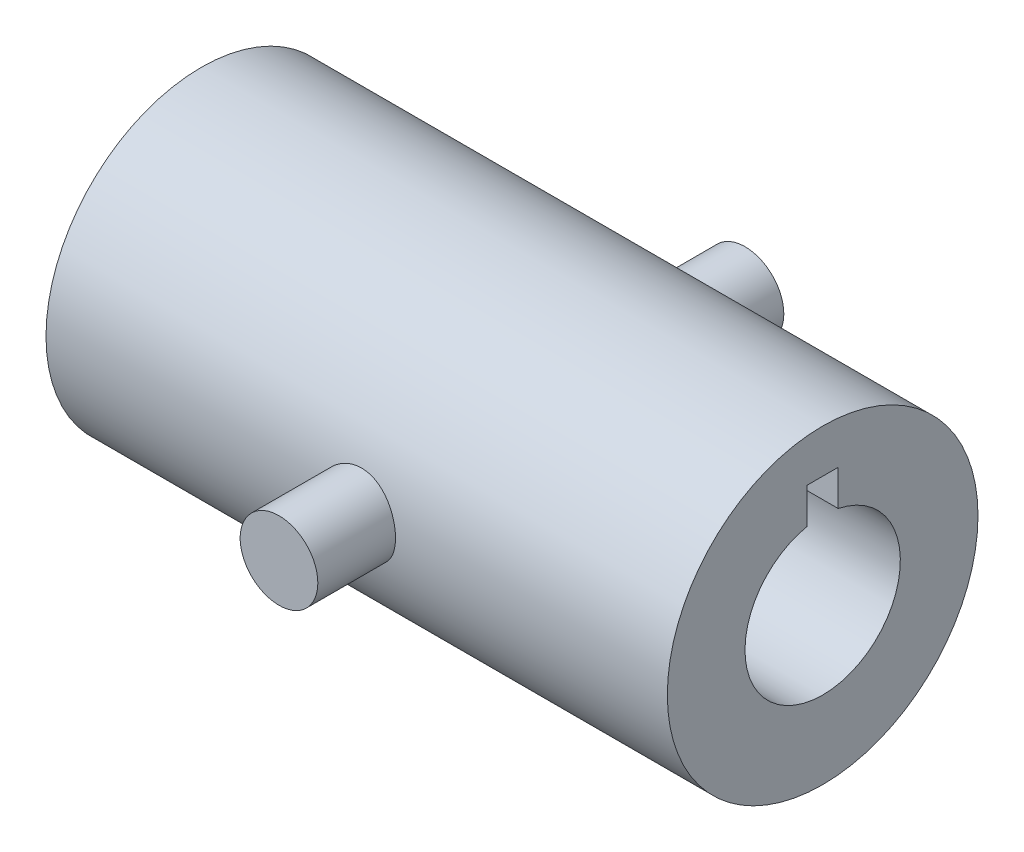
ISO-10303-21;
HEADER;
FILE_DESCRIPTION(('STEP AP214'),'2;1');
FILE_NAME('part.step','',(''),(''),'','','');
FILE_SCHEMA(('AUTOMOTIVE_DESIGN { 1 0 10303 214 1 1 1 1 }'));
ENDSEC;
DATA;
#1=APPLICATION_CONTEXT('core data for automotive mechanical design processes');
#2=APPLICATION_PROTOCOL_DEFINITION('international standard','automotive_design',2000,#1);
#3=PRODUCT_CONTEXT('',#1,'mechanical');
#4=PRODUCT('Part','Part','',(#3));
#5=PRODUCT_RELATED_PRODUCT_CATEGORY('part','',(#4));
#6=PRODUCT_DEFINITION_FORMATION('','',#4);
#7=PRODUCT_DEFINITION_CONTEXT('part definition',#1,'design');
#8=PRODUCT_DEFINITION('design','',#6,#7);
#9=PRODUCT_DEFINITION_SHAPE('','',#8);
#10=(LENGTH_UNIT() NAMED_UNIT(*) SI_UNIT(.MILLI.,.METRE.));
#11=(NAMED_UNIT(*) PLANE_ANGLE_UNIT() SI_UNIT($,.RADIAN.));
#12=(NAMED_UNIT(*) SI_UNIT($,.STERADIAN.) SOLID_ANGLE_UNIT());
#13=UNCERTAINTY_MEASURE_WITH_UNIT(LENGTH_MEASURE(1.E-05),#10,'distance_accuracy_value','');
#14=(GEOMETRIC_REPRESENTATION_CONTEXT(3) GLOBAL_UNCERTAINTY_ASSIGNED_CONTEXT((#13)) GLOBAL_UNIT_ASSIGNED_CONTEXT((#10,
#11,#12)) REPRESENTATION_CONTEXT('',''));
#15=CARTESIAN_POINT('',(0.,0.,0.));
#16=DIRECTION('',(0.,0.,1.));
#17=DIRECTION('',(1.,0.,0.));
#18=AXIS2_PLACEMENT_3D('',#15,#16,#17);
#19=CARTESIAN_POINT('',(50.8,0.,0.));
#20=DIRECTION('',(-1.,0.,0.));
#21=DIRECTION('',(0.,0.,1.));
#22=AXIS2_PLACEMENT_3D('',#19,#20,#21);
#23=CYLINDRICAL_SURFACE('',#22,12.7);
#24=CARTESIAN_POINT('',(22.225,0.,-12.7));
#25=CARTESIAN_POINT('',(22.2250049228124,0.175421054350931,-12.6999970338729));
#26=CARTESIAN_POINT('',(22.2395871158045,0.350897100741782,-12.6963292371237));
#27=CARTESIAN_POINT('',(22.2974432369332,0.696820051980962,-12.6820530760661));
#28=CARTESIAN_POINT('',(22.3407334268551,0.867264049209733,-12.6714407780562));
#29=CARTESIAN_POINT('',(22.4545297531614,1.19807751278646,-12.6444507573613));
#30=CARTESIAN_POINT('',(22.5250032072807,1.35845880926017,-12.6280799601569));
#31=CARTESIAN_POINT('',(22.6910506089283,1.66512267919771,-12.591316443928));
#32=CARTESIAN_POINT('',(22.7866254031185,1.81140477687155,-12.5709235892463));
#33=CARTESIAN_POINT('',(23.0022416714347,2.08873074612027,-12.5278602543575));
#34=CARTESIAN_POINT('',(23.1227028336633,2.21944287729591,-12.5051546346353));
#35=CARTESIAN_POINT('',(23.3837738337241,2.45903522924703,-12.4602582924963));
#36=CARTESIAN_POINT('',(23.524385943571,2.56791298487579,-12.4380676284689));
#37=CARTESIAN_POINT('',(23.8243432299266,2.76230618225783,-12.3963594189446));
#38=CARTESIAN_POINT('',(23.9839356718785,2.84745052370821,-12.3768864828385));
#39=CARTESIAN_POINT('',(24.3157341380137,2.98957345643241,-12.343330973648));
#40=CARTESIAN_POINT('',(24.4879381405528,3.04655655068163,-12.3292475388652));
#41=CARTESIAN_POINT('',(24.8364237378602,3.12960773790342,-12.3084267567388));
#42=CARTESIAN_POINT('',(25.0125545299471,3.15627230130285,-12.3015478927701));
#43=CARTESIAN_POINT('',(25.3669134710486,3.17978742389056,-12.2954915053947));
#44=CARTESIAN_POINT('',(25.5451412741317,3.176642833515,-12.2963127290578));
#45=CARTESIAN_POINT('',(25.8940634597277,3.14110481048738,-12.3054365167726));
#46=CARTESIAN_POINT('',(26.0648357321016,3.10942215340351,-12.3135572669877));
#47=CARTESIAN_POINT('',(26.3985608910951,3.01884119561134,-12.3360753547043));
#48=CARTESIAN_POINT('',(26.5615132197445,2.95994095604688,-12.3504731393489));
#49=CARTESIAN_POINT('',(26.876878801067,2.81599106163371,-12.3840899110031));
#50=CARTESIAN_POINT('',(27.0291690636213,2.73068344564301,-12.4033560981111));
#51=CARTESIAN_POINT('',(27.3175279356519,2.53652078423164,-12.4445122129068));
#52=CARTESIAN_POINT('',(27.4535937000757,2.42766161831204,-12.4664025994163));
#53=CARTESIAN_POINT('',(27.7097143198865,2.18580424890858,-12.5111061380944));
#54=CARTESIAN_POINT('',(27.8292020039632,2.05220624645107,-12.533927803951));
#55=CARTESIAN_POINT('',(28.0441849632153,1.76659522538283,-12.5773596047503));
#56=CARTESIAN_POINT('',(28.1396795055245,1.61458164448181,-12.5979696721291));
#57=CARTESIAN_POINT('',(28.3041737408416,1.29564529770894,-12.6347586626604));
#58=CARTESIAN_POINT('',(28.3730813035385,1.12867311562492,-12.6509221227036));
#59=CARTESIAN_POINT('',(28.4816916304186,0.785020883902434,-12.676884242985));
#60=CARTESIAN_POINT('',(28.5213999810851,0.608342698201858,-12.6866841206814));
#61=CARTESIAN_POINT('',(28.5696185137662,0.255142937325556,-12.6986347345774));
#62=CARTESIAN_POINT('',(28.5789010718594,0.0787330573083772,-12.7009747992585));
#63=CARTESIAN_POINT('',(28.5681229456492,-0.273119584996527,-12.6982813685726));
#64=CARTESIAN_POINT('',(28.5480649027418,-0.448562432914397,-12.6932485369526));
#65=CARTESIAN_POINT('',(28.4798115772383,-0.790816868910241,-12.6764961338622));
#66=CARTESIAN_POINT('',(28.4320376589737,-0.957717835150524,-12.6648767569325));
#67=CARTESIAN_POINT('',(28.3101900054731,-1.28112793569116,-12.6362609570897));
#68=CARTESIAN_POINT('',(28.2361136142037,-1.43763601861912,-12.6192639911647));
#69=CARTESIAN_POINT('',(28.0622668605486,-1.73889063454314,-12.5813250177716));
#70=CARTESIAN_POINT('',(27.9620638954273,-1.88337918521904,-12.5603183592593));
#71=CARTESIAN_POINT('',(27.7393613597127,-2.15376466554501,-12.5167921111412));
#72=CARTESIAN_POINT('',(27.6168579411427,-2.27965837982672,-12.4942722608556));
#73=CARTESIAN_POINT('',(27.3494458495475,-2.51246336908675,-12.4495762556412));
#74=CARTESIAN_POINT('',(27.2040610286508,-2.6188328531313,-12.4274221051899));
#75=CARTESIAN_POINT('',(26.8970492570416,-2.80566443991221,-12.3865825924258));
#76=CARTESIAN_POINT('',(26.735423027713,-2.88612769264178,-12.3678970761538));
#77=CARTESIAN_POINT('',(26.401382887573,-3.01826384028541,-12.3363163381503));
#78=CARTESIAN_POINT('',(26.229039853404,-3.07010730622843,-12.3233869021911));
#79=CARTESIAN_POINT('',(25.8777112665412,-3.14398164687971,-12.3047494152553));
#80=CARTESIAN_POINT('',(25.6987271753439,-3.16601904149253,-12.299039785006));
#81=CARTESIAN_POINT('',(25.3447104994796,-3.17931501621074,-12.2956087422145));
#82=CARTESIAN_POINT('',(25.1697120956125,-3.17143955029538,-12.2976625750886));
#83=CARTESIAN_POINT('',(24.8236234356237,-3.1271152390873,-12.3090074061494));
#84=CARTESIAN_POINT('',(24.6525331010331,-3.09066696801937,-12.3182982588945));
#85=CARTESIAN_POINT('',(24.3200587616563,-2.9907046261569,-12.3429450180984));
#86=CARTESIAN_POINT('',(24.1586230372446,-2.92735297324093,-12.3582644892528));
#87=CARTESIAN_POINT('',(23.8485566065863,-2.7755107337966,-12.3932474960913));
#88=CARTESIAN_POINT('',(23.6999276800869,-2.68701666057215,-12.4129116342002));
#89=CARTESIAN_POINT('',(23.4155093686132,-2.48468673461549,-12.4550092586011));
#90=CARTESIAN_POINT('',(23.2801560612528,-2.37025002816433,-12.4775016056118));
#91=CARTESIAN_POINT('',(23.0302920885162,-2.12045416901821,-12.5223699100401));
#92=CARTESIAN_POINT('',(22.9157863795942,-1.98509005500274,-12.5447458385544));
#93=CARTESIAN_POINT('',(22.7088460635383,-1.6943230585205,-12.5873437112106));
#94=CARTESIAN_POINT('',(22.6168487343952,-1.53860166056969,-12.6075193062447));
#95=CARTESIAN_POINT('',(22.4604845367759,-1.21341315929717,-12.6429542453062));
#96=CARTESIAN_POINT('',(22.3960978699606,-1.04395600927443,-12.6582171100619));
#97=CARTESIAN_POINT('',(22.3063396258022,-0.729001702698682,-12.6798505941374));
#98=CARTESIAN_POINT('',(22.2759032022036,-0.585004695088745,-12.6873547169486));
#99=CARTESIAN_POINT('',(22.2352320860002,-0.294017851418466,-12.6974304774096));
#100=CARTESIAN_POINT('',(22.2249958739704,-0.147028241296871,-12.7000024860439));
#101=CARTESIAN_POINT('',(22.225,0.,-12.7));
#102=B_SPLINE_CURVE_WITH_KNOTS('',3,(#24,#25,#26,#27,#28,#29,#30,#31,#32,#33,#34,#35,#36,#37,
#38,#39,#40,#41,#42,#43,#44,#45,#46,#47,#48,#49,#50,#51,#52,#53,#54,#55,#56,#57,#58,#59,#60,#61,
#62,#63,#64,#65,#66,#67,#68,#69,#70,#71,#72,#73,#74,#75,#76,#77,#78,#79,#80,#81,#82,#83,#84,#85,
#86,#87,#88,#89,#90,#91,#92,#93,#94,#95,#96,#97,#98,#99,#100,#101),.UNSPECIFIED.,.T.,.F.,(4,2,2,
2,2,2,2,2,2,2,2,2,2,2,2,2,2,2,2,2,2,2,2,2,2,2,2,2,2,2,2,2,2,2,2,2,2,2,4),(0.,0.5257243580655,
1.05174676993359,1.57713870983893,2.10254837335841,2.63767221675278,3.17285644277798,
3.71599137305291,4.25903942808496,4.79120824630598,5.32329047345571,5.84247618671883,
6.36169889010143,6.8861628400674,7.41071862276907,7.9502317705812,8.48976139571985,
9.03114418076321,9.57242335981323,10.09985087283,10.6272309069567,11.1467958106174,
11.6664131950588,12.1952509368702,12.7241800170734,13.266092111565,13.8079801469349,
14.34660272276,14.8851074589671,15.4081433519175,15.9311687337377,16.4510804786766,
16.9710643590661,17.5046127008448,18.0382877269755,18.5816279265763,19.1245778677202,
19.5652441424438,20.005877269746),.UNSPECIFIED.);
#103=CARTESIAN_POINT('',(22.225,0.,-12.7));
#104=VERTEX_POINT('',#103);
#105=EDGE_CURVE('E43',#104,#104,#102,.T.);
#106=ORIENTED_EDGE('',*,*,#105,.F.);
#107=EDGE_LOOP('',(#106));
#108=FACE_BOUND('',#107,.T.);
#109=CARTESIAN_POINT('',(50.8,0.,0.));
#110=DIRECTION('',(1.,0.,0.));
#111=DIRECTION('',(0.,0.,-1.));
#112=AXIS2_PLACEMENT_3D('',#109,#110,#111);
#113=CIRCLE('',#112,12.7);
#114=CARTESIAN_POINT('',(50.8,0.,-12.7));
#115=VERTEX_POINT('',#114);
#116=EDGE_CURVE('E113',#115,#115,#113,.T.);
#117=ORIENTED_EDGE('',*,*,#116,.F.);
#118=EDGE_LOOP('',(#117));
#119=FACE_BOUND('',#118,.T.);
#120=CARTESIAN_POINT('',(0.,0.,0.));
#121=DIRECTION('',(1.,0.,0.));
#122=DIRECTION('',(0.,0.,-1.));
#123=AXIS2_PLACEMENT_3D('',#120,#121,#122);
#124=CIRCLE('',#123,12.7);
#125=CARTESIAN_POINT('',(0.,0.,-12.7));
#126=VERTEX_POINT('',#125);
#127=EDGE_CURVE('E38',#126,#126,#124,.T.);
#128=ORIENTED_EDGE('',*,*,#127,.T.);
#129=EDGE_LOOP('',(#128));
#130=FACE_BOUND('',#129,.T.);
#131=CARTESIAN_POINT('',(28.575,0.,12.7));
#132=CARTESIAN_POINT('',(28.5749950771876,0.175421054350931,12.6999970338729));
#133=CARTESIAN_POINT('',(28.5604128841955,0.350897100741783,12.6963292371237));
#134=CARTESIAN_POINT('',(28.5025567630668,0.696820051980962,12.6820530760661));
#135=CARTESIAN_POINT('',(28.4592665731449,0.867264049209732,12.6714407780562));
#136=CARTESIAN_POINT('',(28.3454702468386,1.19807751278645,12.6444507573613));
#137=CARTESIAN_POINT('',(28.2749967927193,1.35845880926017,12.6280799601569));
#138=CARTESIAN_POINT('',(28.1089493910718,1.6651226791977,12.591316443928));
#139=CARTESIAN_POINT('',(28.0133745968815,1.81140477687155,12.5709235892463));
#140=CARTESIAN_POINT('',(27.7977583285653,2.08873074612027,12.5278602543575));
#141=CARTESIAN_POINT('',(27.6772971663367,2.2194428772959,12.5051546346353));
#142=CARTESIAN_POINT('',(27.4162261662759,2.45903522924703,12.4602582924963));
#143=CARTESIAN_POINT('',(27.275614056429,2.56791298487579,12.4380676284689));
#144=CARTESIAN_POINT('',(26.9756567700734,2.76230618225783,12.3963594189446));
#145=CARTESIAN_POINT('',(26.8160643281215,2.84745052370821,12.3768864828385));
#146=CARTESIAN_POINT('',(26.4842658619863,2.98957345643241,12.343330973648));
#147=CARTESIAN_POINT('',(26.3120618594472,3.04655655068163,12.3292475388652));
#148=CARTESIAN_POINT('',(25.9635762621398,3.12960773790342,12.3084267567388));
#149=CARTESIAN_POINT('',(25.7874454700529,3.15627230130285,12.3015478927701));
#150=CARTESIAN_POINT('',(25.4330865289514,3.17978742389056,12.2954915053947));
#151=CARTESIAN_POINT('',(25.2548587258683,3.176642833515,12.2963127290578));
#152=CARTESIAN_POINT('',(24.9059365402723,3.14110481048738,12.3054365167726));
#153=CARTESIAN_POINT('',(24.7351642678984,3.10942215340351,12.3135572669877));
#154=CARTESIAN_POINT('',(24.4014391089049,3.01884119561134,12.3360753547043));
#155=CARTESIAN_POINT('',(24.2384867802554,2.95994095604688,12.3504731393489));
#156=CARTESIAN_POINT('',(23.923121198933,2.81599106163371,12.3840899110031));
#157=CARTESIAN_POINT('',(23.7708309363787,2.73068344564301,12.4033560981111));
#158=CARTESIAN_POINT('',(23.4824720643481,2.53652078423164,12.4445122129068));
#159=CARTESIAN_POINT('',(23.3464062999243,2.42766161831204,12.4664025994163));
#160=CARTESIAN_POINT('',(23.0902856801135,2.18580424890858,12.5111061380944));
#161=CARTESIAN_POINT('',(22.9707979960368,2.05220624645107,12.533927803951));
#162=CARTESIAN_POINT('',(22.7558150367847,1.76659522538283,12.5773596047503));
#163=CARTESIAN_POINT('',(22.6603204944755,1.61458164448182,12.5979696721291));
#164=CARTESIAN_POINT('',(22.4958262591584,1.29564529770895,12.6347586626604));
#165=CARTESIAN_POINT('',(22.4269186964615,1.12867311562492,12.6509221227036));
#166=CARTESIAN_POINT('',(22.3183083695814,0.785020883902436,12.676884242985));
#167=CARTESIAN_POINT('',(22.2786000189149,0.60834269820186,12.6866841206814));
#168=CARTESIAN_POINT('',(22.2303814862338,0.255142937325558,12.6986347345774));
#169=CARTESIAN_POINT('',(22.2210989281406,0.0787330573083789,12.7009747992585));
#170=CARTESIAN_POINT('',(22.2318770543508,-0.273119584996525,12.6982813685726));
#171=CARTESIAN_POINT('',(22.2519350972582,-0.448562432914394,12.6932485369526));
#172=CARTESIAN_POINT('',(22.3201884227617,-0.790816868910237,12.6764961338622));
#173=CARTESIAN_POINT('',(22.3679623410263,-0.95771783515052,12.6648767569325));
#174=CARTESIAN_POINT('',(22.4898099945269,-1.28112793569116,12.6362609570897));
#175=CARTESIAN_POINT('',(22.5638863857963,-1.43763601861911,12.6192639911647));
#176=CARTESIAN_POINT('',(22.7377331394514,-1.73889063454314,12.5813250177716));
#177=CARTESIAN_POINT('',(22.8379361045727,-1.88337918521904,12.5603183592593));
#178=CARTESIAN_POINT('',(23.0606386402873,-2.15376466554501,12.5167921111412));
#179=CARTESIAN_POINT('',(23.1831420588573,-2.27965837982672,12.4942722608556));
#180=CARTESIAN_POINT('',(23.4505541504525,-2.51246336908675,12.4495762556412));
#181=CARTESIAN_POINT('',(23.5959389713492,-2.6188328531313,12.4274221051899));
#182=CARTESIAN_POINT('',(23.9029507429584,-2.80566443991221,12.3865825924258));
#183=CARTESIAN_POINT('',(24.064576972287,-2.88612769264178,12.3678970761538));
#184=CARTESIAN_POINT('',(24.398617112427,-3.0182638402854,12.3363163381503));
#185=CARTESIAN_POINT('',(24.570960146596,-3.07010730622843,12.3233869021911));
#186=CARTESIAN_POINT('',(24.9222887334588,-3.14398164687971,12.3047494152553));
#187=CARTESIAN_POINT('',(25.1012728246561,-3.16601904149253,12.299039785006));
#188=CARTESIAN_POINT('',(25.4552895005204,-3.17931501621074,12.2956087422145));
#189=CARTESIAN_POINT('',(25.6302879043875,-3.17143955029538,12.2976625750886));
#190=CARTESIAN_POINT('',(25.9763765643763,-3.1271152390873,12.3090074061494));
#191=CARTESIAN_POINT('',(26.1474668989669,-3.09066696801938,12.3182982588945));
#192=CARTESIAN_POINT('',(26.4799412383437,-2.99070462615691,12.3429450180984));
#193=CARTESIAN_POINT('',(26.6413769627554,-2.92735297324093,12.3582644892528));
#194=CARTESIAN_POINT('',(26.9514433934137,-2.7755107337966,12.3932474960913));
#195=CARTESIAN_POINT('',(27.1000723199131,-2.68701666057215,12.4129116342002));
#196=CARTESIAN_POINT('',(27.3844906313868,-2.4846867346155,12.4550092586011));
#197=CARTESIAN_POINT('',(27.5198439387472,-2.37025002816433,12.4775016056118));
#198=CARTESIAN_POINT('',(27.7697079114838,-2.12045416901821,12.5223699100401));
#199=CARTESIAN_POINT('',(27.8842136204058,-1.98509005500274,12.5447458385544));
#200=CARTESIAN_POINT('',(28.0911539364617,-1.6943230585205,12.5873437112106));
#201=CARTESIAN_POINT('',(28.1831512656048,-1.53860166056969,12.6075193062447));
#202=CARTESIAN_POINT('',(28.3395154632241,-1.21341315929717,12.6429542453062));
#203=CARTESIAN_POINT('',(28.4039021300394,-1.04395600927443,12.6582171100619));
#204=CARTESIAN_POINT('',(28.4936603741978,-0.729001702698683,12.6798505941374));
#205=CARTESIAN_POINT('',(28.5240967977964,-0.585004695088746,12.6873547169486));
#206=CARTESIAN_POINT('',(28.5647679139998,-0.294017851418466,12.6974304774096));
#207=CARTESIAN_POINT('',(28.5750041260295,-0.147028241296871,12.7000024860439));
#208=CARTESIAN_POINT('',(28.575,0.,12.7));
#209=B_SPLINE_CURVE_WITH_KNOTS('',3,(#131,#132,#133,#134,#135,#136,#137,#138,#139,#140,#141,
#142,#143,#144,#145,#146,#147,#148,#149,#150,#151,#152,#153,#154,#155,#156,#157,#158,#159,#160,
#161,#162,#163,#164,#165,#166,#167,#168,#169,#170,#171,#172,#173,#174,#175,#176,#177,#178,#179,
#180,#181,#182,#183,#184,#185,#186,#187,#188,#189,#190,#191,#192,#193,#194,#195,#196,#197,#198,
#199,#200,#201,#202,#203,#204,#205,#206,#207,#208),.UNSPECIFIED.,.T.,.F.,(4,2,2,2,2,2,2,2,2,2,2,
2,2,2,2,2,2,2,2,2,2,2,2,2,2,2,2,2,2,2,2,2,2,2,2,2,2,2,4),(0.,0.5257243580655,1.05174676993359,
1.57713870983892,2.10254837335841,2.63767221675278,3.17285644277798,3.71599137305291,
4.25903942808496,4.79120824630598,5.3232904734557,5.84247618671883,6.36169889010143,
6.8861628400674,7.41071862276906,7.9502317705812,8.48976139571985,9.0311441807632,
9.57242335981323,10.09985087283,10.6272309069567,11.1467958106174,11.6664131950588,
12.1952509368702,12.7241800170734,13.266092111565,13.8079801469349,14.34660272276,
14.8851074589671,15.4081433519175,15.9311687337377,16.4510804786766,16.9710643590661,
17.5046127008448,18.0382877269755,18.5816279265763,19.1245778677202,19.5652441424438,
20.005877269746),.UNSPECIFIED.);
#210=CARTESIAN_POINT('',(28.575,0.,12.7));
#211=VERTEX_POINT('',#210);
#212=EDGE_CURVE('E11',#211,#211,#209,.T.);
#213=ORIENTED_EDGE('',*,*,#212,.F.);
#214=EDGE_LOOP('',(#213));
#215=FACE_BOUND('',#214,.T.);
#216=ADVANCED_FACE('F34',(#108,#119,#130,#215),#23,.T.);
#217=CARTESIAN_POINT('',(50.8,0.,0.));
#218=DIRECTION('',(-1.,0.,0.));
#219=DIRECTION('',(0.,0.,1.));
#220=AXIS2_PLACEMENT_3D('',#217,#218,#219);
#221=CYLINDRICAL_SURFACE('',#220,6.35);
#222=CARTESIAN_POINT('',(0.,0.,0.));
#223=DIRECTION('',(1.,0.,0.));
#224=DIRECTION('',(0.,0.,-1.));
#225=AXIS2_PLACEMENT_3D('',#222,#223,#224);
#226=CIRCLE('',#225,6.35);
#227=CARTESIAN_POINT('',(0.,6.22170394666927,1.27));
#228=VERTEX_POINT('',#227);
#229=CARTESIAN_POINT('',(0.,6.22170394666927,-1.27));
#230=VERTEX_POINT('',#229);
#231=EDGE_CURVE('E59',#228,#230,#226,.T.);
#232=ORIENTED_EDGE('',*,*,#231,.F.);
#233=DIRECTION('',(-1.,0.,0.));
#234=VECTOR('',#233,1.);
#235=CARTESIAN_POINT('',(50.8,6.22170394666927,1.27));
#236=LINE('',#235,#234);
#237=CARTESIAN_POINT('',(50.8,6.22170394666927,1.27));
#238=VERTEX_POINT('',#237);
#239=EDGE_CURVE('E81',#238,#228,#236,.T.);
#240=ORIENTED_EDGE('',*,*,#239,.F.);
#241=CARTESIAN_POINT('',(50.8,0.,0.));
#242=DIRECTION('',(1.,0.,0.));
#243=DIRECTION('',(0.,0.,-1.));
#244=AXIS2_PLACEMENT_3D('',#241,#242,#243);
#245=CIRCLE('',#244,6.35);
#246=CARTESIAN_POINT('',(50.8,6.22170394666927,-1.27));
#247=VERTEX_POINT('',#246);
#248=EDGE_CURVE('E77',#238,#247,#245,.T.);
#249=ORIENTED_EDGE('',*,*,#248,.T.);
#250=DIRECTION('',(-1.,0.,0.));
#251=VECTOR('',#250,1.);
#252=CARTESIAN_POINT('',(50.8,6.22170394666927,-1.27));
#253=LINE('',#252,#251);
#254=EDGE_CURVE('E80',#247,#230,#253,.T.);
#255=ORIENTED_EDGE('',*,*,#254,.T.);
#256=EDGE_LOOP('',(#232,#240,#249,#255));
#257=FACE_BOUND('',#256,.T.);
#258=ADVANCED_FACE('F79',(#257),#221,.F.);
#259=CARTESIAN_POINT('',(50.8,0.,0.));
#260=DIRECTION('',(1.,0.,0.));
#261=DIRECTION('',(0.,0.,-1.));
#262=AXIS2_PLACEMENT_3D('',#259,#260,#261);
#263=PLANE('',#262);
#264=ORIENTED_EDGE('',*,*,#116,.T.);
#265=EDGE_LOOP('',(#264));
#266=FACE_BOUND('',#265,.T.);
#267=DIRECTION('',(0.,1.,0.));
#268=VECTOR('',#267,1.);
#269=CARTESIAN_POINT('',(50.8,9.14170394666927,-1.27));
#270=LINE('',#269,#268);
#271=CARTESIAN_POINT('',(50.8,9.14170394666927,-1.27));
#272=VERTEX_POINT('',#271);
#273=EDGE_CURVE('E85',#247,#272,#270,.T.);
#274=ORIENTED_EDGE('',*,*,#273,.F.);
#275=ORIENTED_EDGE('',*,*,#248,.F.);
#276=DIRECTION('',(0.,-1.,0.));
#277=VECTOR('',#276,1.);
#278=CARTESIAN_POINT('',(50.8,6.22170394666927,1.27));
#279=LINE('',#278,#277);
#280=CARTESIAN_POINT('',(50.8,9.14170394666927,1.27));
#281=VERTEX_POINT('',#280);
#282=EDGE_CURVE('E99',#281,#238,#279,.T.);
#283=ORIENTED_EDGE('',*,*,#282,.F.);
#284=DIRECTION('',(0.,0.,1.));
#285=VECTOR('',#284,1.);
#286=CARTESIAN_POINT('',(50.8,9.14170394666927,1.27));
#287=LINE('',#286,#285);
#288=EDGE_CURVE('E97',#272,#281,#287,.T.);
#289=ORIENTED_EDGE('',*,*,#288,.F.);
#290=EDGE_LOOP('',(#274,#275,#283,#289));
#291=FACE_BOUND('',#290,.T.);
#292=ADVANCED_FACE('F96',(#266,#291),#263,.T.);
#293=CARTESIAN_POINT('',(0.,0.,0.));
#294=DIRECTION('',(1.,0.,0.));
#295=DIRECTION('',(0.,0.,-1.));
#296=AXIS2_PLACEMENT_3D('',#293,#294,#295);
#297=PLANE('',#296);
#298=ORIENTED_EDGE('',*,*,#127,.F.);
#299=EDGE_LOOP('',(#298));
#300=FACE_BOUND('',#299,.T.);
#301=ORIENTED_EDGE('',*,*,#231,.T.);
#302=DIRECTION('',(0.,1.,0.));
#303=VECTOR('',#302,1.);
#304=CARTESIAN_POINT('',(0.,9.14170394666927,-1.27));
#305=LINE('',#304,#303);
#306=CARTESIAN_POINT('',(0.,9.14170394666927,-1.27));
#307=VERTEX_POINT('',#306);
#308=EDGE_CURVE('E92',#230,#307,#305,.T.);
#309=ORIENTED_EDGE('',*,*,#308,.T.);
#310=DIRECTION('',(0.,0.,1.));
#311=VECTOR('',#310,1.);
#312=CARTESIAN_POINT('',(0.,9.14170394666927,1.27));
#313=LINE('',#312,#311);
#314=CARTESIAN_POINT('',(0.,9.14170394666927,1.27));
#315=VERTEX_POINT('',#314);
#316=EDGE_CURVE('E106',#307,#315,#313,.T.);
#317=ORIENTED_EDGE('',*,*,#316,.T.);
#318=DIRECTION('',(0.,-1.,0.));
#319=VECTOR('',#318,1.);
#320=CARTESIAN_POINT('',(0.,6.22170394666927,1.27));
#321=LINE('',#320,#319);
#322=EDGE_CURVE('E86',#315,#228,#321,.T.);
#323=ORIENTED_EDGE('',*,*,#322,.T.);
#324=EDGE_LOOP('',(#301,#309,#317,#323));
#325=FACE_BOUND('',#324,.T.);
#326=ADVANCED_FACE('F124',(#300,#325),#297,.F.);
#327=CARTESIAN_POINT('',(50.8,9.14170394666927,-1.27));
#328=DIRECTION('',(0.,0.,1.));
#329=DIRECTION('',(0.,-1.,0.));
#330=AXIS2_PLACEMENT_3D('',#327,#328,#329);
#331=PLANE('',#330);
#332=ORIENTED_EDGE('',*,*,#308,.F.);
#333=ORIENTED_EDGE('',*,*,#254,.F.);
#334=ORIENTED_EDGE('',*,*,#273,.T.);
#335=DIRECTION('',(-1.,0.,0.));
#336=VECTOR('',#335,1.);
#337=CARTESIAN_POINT('',(50.8,9.14170394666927,-1.27));
#338=LINE('',#337,#336);
#339=EDGE_CURVE('E93',#272,#307,#338,.T.);
#340=ORIENTED_EDGE('',*,*,#339,.T.);
#341=EDGE_LOOP('',(#332,#333,#334,#340));
#342=FACE_BOUND('',#341,.T.);
#343=ADVANCED_FACE('F89',(#342),#331,.T.);
#344=CARTESIAN_POINT('',(50.8,9.14170394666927,1.27));
#345=DIRECTION('',(0.,-1.,0.));
#346=DIRECTION('',(0.,0.,-1.));
#347=AXIS2_PLACEMENT_3D('',#344,#345,#346);
#348=PLANE('',#347);
#349=ORIENTED_EDGE('',*,*,#316,.F.);
#350=ORIENTED_EDGE('',*,*,#339,.F.);
#351=ORIENTED_EDGE('',*,*,#288,.T.);
#352=DIRECTION('',(-1.,0.,0.));
#353=VECTOR('',#352,1.);
#354=CARTESIAN_POINT('',(50.8,9.14170394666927,1.27));
#355=LINE('',#354,#353);
#356=EDGE_CURVE('E51',#281,#315,#355,.T.);
#357=ORIENTED_EDGE('',*,*,#356,.T.);
#358=EDGE_LOOP('',(#349,#350,#351,#357));
#359=FACE_BOUND('',#358,.T.);
#360=ADVANCED_FACE('F131',(#359),#348,.T.);
#361=CARTESIAN_POINT('',(50.8,6.22170394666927,1.27));
#362=DIRECTION('',(0.,0.,-1.));
#363=DIRECTION('',(-1.,0.,0.));
#364=AXIS2_PLACEMENT_3D('',#361,#362,#363);
#365=PLANE('',#364);
#366=ORIENTED_EDGE('',*,*,#322,.F.);
#367=ORIENTED_EDGE('',*,*,#356,.F.);
#368=ORIENTED_EDGE('',*,*,#282,.T.);
#369=ORIENTED_EDGE('',*,*,#239,.T.);
#370=EDGE_LOOP('',(#366,#367,#368,#369));
#371=FACE_BOUND('',#370,.T.);
#372=ADVANCED_FACE('F128',(#371),#365,.T.);
#373=CARTESIAN_POINT('',(25.4,0.,-19.05));
#374=DIRECTION('',(0.,0.,1.));
#375=DIRECTION('',(1.,0.,0.));
#376=AXIS2_PLACEMENT_3D('',#373,#374,#375);
#377=PLANE('',#376);
#378=CARTESIAN_POINT('',(25.4,0.,-19.05));
#379=DIRECTION('',(0.,0.,1.));
#380=DIRECTION('',(1.,0.,0.));
#381=AXIS2_PLACEMENT_3D('',#378,#379,#380);
#382=CIRCLE('',#381,3.175);
#383=CARTESIAN_POINT('',(28.575,0.,-19.05));
#384=VERTEX_POINT('',#383);
#385=EDGE_CURVE('E171',#384,#384,#382,.T.);
#386=ORIENTED_EDGE('',*,*,#385,.F.);
#387=EDGE_LOOP('',(#386));
#388=FACE_BOUND('',#387,.T.);
#389=ADVANCED_FACE('F130',(#388),#377,.F.);
#390=CARTESIAN_POINT('',(25.4,0.,19.05));
#391=DIRECTION('',(0.,0.,-1.));
#392=DIRECTION('',(-1.,0.,0.));
#393=AXIS2_PLACEMENT_3D('',#390,#391,#392);
#394=CYLINDRICAL_SURFACE('',#393,3.175);
#395=ORIENTED_EDGE('',*,*,#385,.T.);
#396=EDGE_LOOP('',(#395));
#397=FACE_BOUND('',#396,.T.);
#398=ORIENTED_EDGE('',*,*,#105,.T.);
#399=EDGE_LOOP('',(#398));
#400=FACE_BOUND('',#399,.T.);
#401=ADVANCED_FACE('F137',(#397,#400),#394,.T.);
#402=CARTESIAN_POINT('',(25.4,0.,19.05));
#403=DIRECTION('',(0.,0.,1.));
#404=DIRECTION('',(1.,0.,0.));
#405=AXIS2_PLACEMENT_3D('',#402,#403,#404);
#406=CIRCLE('',#405,3.175);
#407=CARTESIAN_POINT('',(28.575,0.,19.05));
#408=VERTEX_POINT('',#407);
#409=EDGE_CURVE('E104',#408,#408,#406,.T.);
#410=ORIENTED_EDGE('',*,*,#409,.F.);
#411=EDGE_LOOP('',(#410));
#412=FACE_BOUND('',#411,.T.);
#413=ORIENTED_EDGE('',*,*,#212,.T.);
#414=EDGE_LOOP('',(#413));
#415=FACE_BOUND('',#414,.T.);
#416=ADVANCED_FACE('F153',(#412,#415),#394,.T.);
#417=CARTESIAN_POINT('',(25.4,0.,19.05));
#418=DIRECTION('',(0.,0.,1.));
#419=DIRECTION('',(1.,0.,0.));
#420=AXIS2_PLACEMENT_3D('',#417,#418,#419);
#421=PLANE('',#420);
#422=ORIENTED_EDGE('',*,*,#409,.T.);
#423=EDGE_LOOP('',(#422));
#424=FACE_BOUND('',#423,.T.);
#425=ADVANCED_FACE('F158',(#424),#421,.T.);
#426=CLOSED_SHELL('',(#216,#258,#292,#326,#343,#360,#372,#389,#401,#416,#425));
#427=MANIFOLD_SOLID_BREP('B2',#426);
#428=ADVANCED_BREP_SHAPE_REPRESENTATION('',(#18,#427),#14);
#429=SHAPE_DEFINITION_REPRESENTATION(#9,#428);
ENDSEC;
END-ISO-10303-21;
